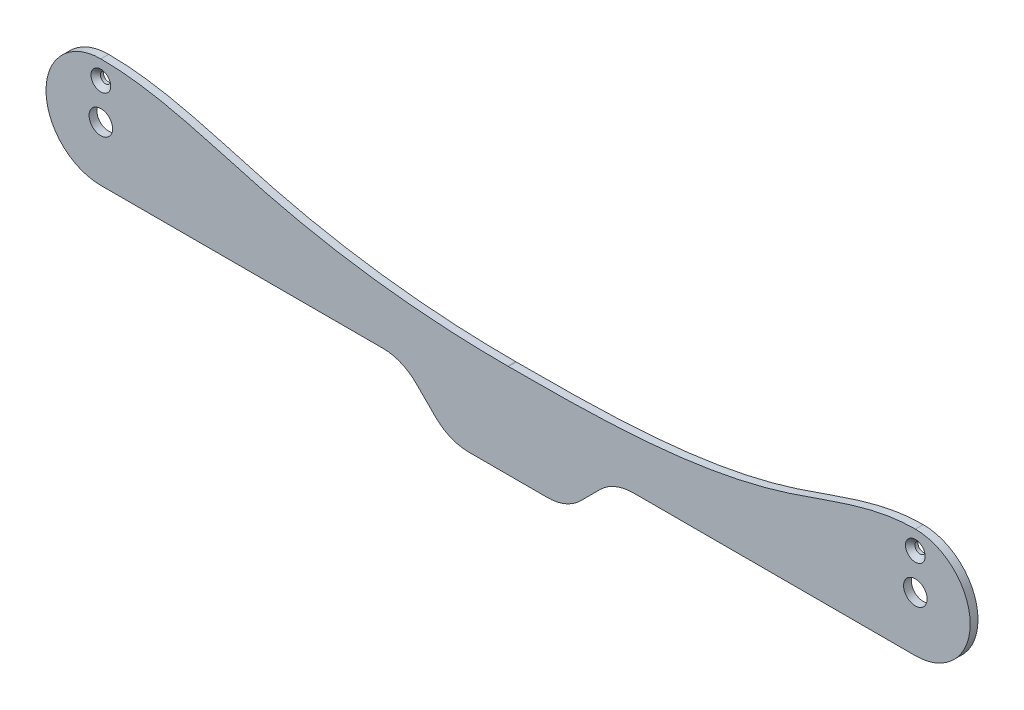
ISO-10303-21;
HEADER;
FILE_DESCRIPTION(('STEP AP214'),'2;1');
FILE_NAME('part.step','',(''),(''),'','','');
FILE_SCHEMA(('AUTOMOTIVE_DESIGN { 1 0 10303 214 1 1 1 1 }'));
ENDSEC;
DATA;
#1=APPLICATION_CONTEXT('core data for automotive mechanical design processes');
#2=APPLICATION_PROTOCOL_DEFINITION('international standard','automotive_design',2000,#1);
#3=PRODUCT_CONTEXT('',#1,'mechanical');
#4=PRODUCT('Part','Part','',(#3));
#5=PRODUCT_RELATED_PRODUCT_CATEGORY('part','',(#4));
#6=PRODUCT_DEFINITION_FORMATION('','',#4);
#7=PRODUCT_DEFINITION_CONTEXT('part definition',#1,'design');
#8=PRODUCT_DEFINITION('design','',#6,#7);
#9=PRODUCT_DEFINITION_SHAPE('','',#8);
#10=(LENGTH_UNIT() NAMED_UNIT(*) SI_UNIT(.MILLI.,.METRE.));
#11=(NAMED_UNIT(*) PLANE_ANGLE_UNIT() SI_UNIT($,.RADIAN.));
#12=(NAMED_UNIT(*) SI_UNIT($,.STERADIAN.) SOLID_ANGLE_UNIT());
#13=UNCERTAINTY_MEASURE_WITH_UNIT(LENGTH_MEASURE(1.E-05),#10,'distance_accuracy_value','');
#14=(GEOMETRIC_REPRESENTATION_CONTEXT(3) GLOBAL_UNCERTAINTY_ASSIGNED_CONTEXT((#13)) GLOBAL_UNIT_ASSIGNED_CONTEXT((#10,
#11,#12)) REPRESENTATION_CONTEXT('',''));
#15=CARTESIAN_POINT('',(0.,0.,0.));
#16=DIRECTION('',(0.,0.,1.));
#17=DIRECTION('',(1.,0.,0.));
#18=AXIS2_PLACEMENT_3D('',#15,#16,#17);
#19=CARTESIAN_POINT('',(-260.,0.,5.));
#20=DIRECTION('',(0.,0.,-1.));
#21=DIRECTION('',(-1.,0.,0.));
#22=AXIS2_PLACEMENT_3D('',#19,#20,#21);
#23=CYLINDRICAL_SURFACE('',#22,35.);
#24=DIRECTION('',(0.,0.,-1.));
#25=VECTOR('',#24,1.);
#26=CARTESIAN_POINT('',(-260.,-35.,5.));
#27=LINE('',#26,#25);
#28=CARTESIAN_POINT('',(-260.,-35.,5.));
#29=VERTEX_POINT('',#28);
#30=CARTESIAN_POINT('',(-260.,-35.,0.));
#31=VERTEX_POINT('',#30);
#32=EDGE_CURVE('E179',#29,#31,#27,.T.);
#33=ORIENTED_EDGE('',*,*,#32,.F.);
#34=CARTESIAN_POINT('',(-260.,0.,5.));
#35=DIRECTION('',(0.,0.,1.));
#36=DIRECTION('',(1.,0.,0.));
#37=AXIS2_PLACEMENT_3D('',#34,#35,#36);
#38=CIRCLE('',#37,35.);
#39=CARTESIAN_POINT('',(-260.,35.,5.));
#40=VERTEX_POINT('',#39);
#41=EDGE_CURVE('E330',#40,#29,#38,.T.);
#42=ORIENTED_EDGE('',*,*,#41,.F.);
#43=DIRECTION('',(0.,0.,-1.));
#44=VECTOR('',#43,1.);
#45=CARTESIAN_POINT('',(-260.,35.,5.));
#46=LINE('',#45,#44);
#47=CARTESIAN_POINT('',(-260.,35.,0.));
#48=VERTEX_POINT('',#47);
#49=EDGE_CURVE('E332',#48,#40,#46,.F.);
#50=ORIENTED_EDGE('',*,*,#49,.F.);
#51=CARTESIAN_POINT('',(-260.,0.,0.));
#52=DIRECTION('',(0.,0.,1.));
#53=DIRECTION('',(1.,0.,0.));
#54=AXIS2_PLACEMENT_3D('',#51,#52,#53);
#55=CIRCLE('',#54,35.);
#56=EDGE_CURVE('E326',#31,#48,#55,.F.);
#57=ORIENTED_EDGE('',*,*,#56,.F.);
#58=EDGE_LOOP('',(#33,#42,#50,#57));
#59=FACE_BOUND('',#58,.T.);
#60=ADVANCED_FACE('F37',(#59),#23,.T.);
#61=CARTESIAN_POINT('',(260.,0.,5.));
#62=DIRECTION('',(0.,0.,-1.));
#63=DIRECTION('',(-1.,0.,0.));
#64=AXIS2_PLACEMENT_3D('',#61,#62,#63);
#65=CYLINDRICAL_SURFACE('',#64,35.);
#66=DIRECTION('',(0.,0.,-1.));
#67=VECTOR('',#66,1.);
#68=CARTESIAN_POINT('',(260.,35.,5.));
#69=LINE('',#68,#67);
#70=CARTESIAN_POINT('',(260.,35.,5.));
#71=VERTEX_POINT('',#70);
#72=CARTESIAN_POINT('',(260.,35.,0.));
#73=VERTEX_POINT('',#72);
#74=EDGE_CURVE('E147',#71,#73,#69,.T.);
#75=ORIENTED_EDGE('',*,*,#74,.F.);
#76=CARTESIAN_POINT('',(260.,0.,5.));
#77=DIRECTION('',(0.,0.,1.));
#78=DIRECTION('',(1.,0.,0.));
#79=AXIS2_PLACEMENT_3D('',#76,#77,#78);
#80=CIRCLE('',#79,35.);
#81=CARTESIAN_POINT('',(260.,-35.,5.));
#82=VERTEX_POINT('',#81);
#83=EDGE_CURVE('E153',#82,#71,#80,.T.);
#84=ORIENTED_EDGE('',*,*,#83,.F.);
#85=DIRECTION('',(0.,0.,-1.));
#86=VECTOR('',#85,1.);
#87=CARTESIAN_POINT('',(260.,-35.,5.));
#88=LINE('',#87,#86);
#89=CARTESIAN_POINT('',(260.,-35.,0.));
#90=VERTEX_POINT('',#89);
#91=EDGE_CURVE('E162',#90,#82,#88,.F.);
#92=ORIENTED_EDGE('',*,*,#91,.F.);
#93=CARTESIAN_POINT('',(260.,0.,0.));
#94=DIRECTION('',(0.,0.,1.));
#95=DIRECTION('',(1.,0.,0.));
#96=AXIS2_PLACEMENT_3D('',#93,#94,#95);
#97=CIRCLE('',#96,35.);
#98=EDGE_CURVE('E161',#73,#90,#97,.F.);
#99=ORIENTED_EDGE('',*,*,#98,.F.);
#100=EDGE_LOOP('',(#75,#84,#92,#99));
#101=FACE_BOUND('',#100,.T.);
#102=ADVANCED_FACE('F165',(#101),#65,.T.);
#103=CARTESIAN_POINT('',(-295.,-35.,5.));
#104=DIRECTION('',(0.,1.,0.));
#105=DIRECTION('',(0.,0.,1.));
#106=AXIS2_PLACEMENT_3D('',#103,#104,#105);
#107=PLANE('',#106);
#108=DIRECTION('',(1.,0.,0.));
#109=VECTOR('',#108,1.);
#110=CARTESIAN_POINT('',(-295.,-35.,0.));
#111=LINE('',#110,#109);
#112=CARTESIAN_POINT('',(-79.9264068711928,-35.,0.));
#113=VERTEX_POINT('',#112);
#114=EDGE_CURVE('E370',#31,#113,#111,.T.);
#115=ORIENTED_EDGE('',*,*,#114,.T.);
#116=DIRECTION('',(0.,0.,-1.));
#117=VECTOR('',#116,1.);
#118=CARTESIAN_POINT('',(-79.9264068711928,-35.,5.));
#119=LINE('',#118,#117);
#120=CARTESIAN_POINT('',(-79.9264068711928,-35.,5.));
#121=VERTEX_POINT('',#120);
#122=EDGE_CURVE('E304',#113,#121,#119,.F.);
#123=ORIENTED_EDGE('',*,*,#122,.T.);
#124=DIRECTION('',(1.,0.,0.));
#125=VECTOR('',#124,1.);
#126=CARTESIAN_POINT('',(-295.,-35.,5.));
#127=LINE('',#126,#125);
#128=EDGE_CURVE('E167',#29,#121,#127,.T.);
#129=ORIENTED_EDGE('',*,*,#128,.F.);
#130=ORIENTED_EDGE('',*,*,#32,.T.);
#131=EDGE_LOOP('',(#115,#123,#129,#130));
#132=FACE_BOUND('',#131,.T.);
#133=ADVANCED_FACE('F248',(#132),#107,.F.);
#134=CARTESIAN_POINT('',(79.9264068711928,-35.,5.));
#135=VERTEX_POINT('',#134);
#136=EDGE_CURVE('E157',#135,#82,#127,.T.);
#137=ORIENTED_EDGE('',*,*,#136,.F.);
#138=DIRECTION('',(0.,0.,-1.));
#139=VECTOR('',#138,1.);
#140=CARTESIAN_POINT('',(79.9264068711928,-35.,5.));
#141=LINE('',#140,#139);
#142=CARTESIAN_POINT('',(79.9264068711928,-35.,0.));
#143=VERTEX_POINT('',#142);
#144=EDGE_CURVE('E306',#135,#143,#141,.T.);
#145=ORIENTED_EDGE('',*,*,#144,.T.);
#146=EDGE_CURVE('E368',#143,#90,#111,.T.);
#147=ORIENTED_EDGE('',*,*,#146,.T.);
#148=ORIENTED_EDGE('',*,*,#91,.T.);
#149=EDGE_LOOP('',(#137,#145,#147,#148));
#150=FACE_BOUND('',#149,.T.);
#151=ADVANCED_FACE('F241',(#150),#107,.F.);
#152=CARTESIAN_POINT('',(0.,0.,5.));
#153=DIRECTION('',(0.,0.,1.));
#154=DIRECTION('',(1.,0.,0.));
#155=AXIS2_PLACEMENT_3D('',#152,#153,#154);
#156=PLANE('',#155);
#157=CARTESIAN_POINT('',(-260.,23.,5.));
#158=DIRECTION('',(0.,0.,1.));
#159=DIRECTION('',(1.,0.,0.));
#160=AXIS2_PLACEMENT_3D('',#157,#158,#159);
#161=CIRCLE('',#160,6.30000000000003);
#162=CARTESIAN_POINT('',(-253.7,23.,5.));
#163=VERTEX_POINT('',#162);
#164=EDGE_CURVE('E590',#163,#163,#161,.T.);
#165=ORIENTED_EDGE('',*,*,#164,.F.);
#166=EDGE_LOOP('',(#165));
#167=FACE_BOUND('',#166,.T.);
#168=CARTESIAN_POINT('',(260.,23.,5.));
#169=DIRECTION('',(0.,0.,1.));
#170=DIRECTION('',(1.,0.,0.));
#171=AXIS2_PLACEMENT_3D('',#168,#169,#170);
#172=CIRCLE('',#171,6.30000000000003);
#173=CARTESIAN_POINT('',(266.3,23.,5.));
#174=VERTEX_POINT('',#173);
#175=EDGE_CURVE('E188',#174,#174,#172,.T.);
#176=ORIENTED_EDGE('',*,*,#175,.F.);
#177=EDGE_LOOP('',(#176));
#178=FACE_BOUND('',#177,.T.);
#179=CARTESIAN_POINT('',(-260.,35.,5.));
#180=CARTESIAN_POINT('',(-223.891175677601,35.,5.));
#181=CARTESIAN_POINT('',(-140.488701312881,4.66700414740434,5.));
#182=CARTESIAN_POINT('',(-52.6489725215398,-5.00000000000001,5.));
#183=CARTESIAN_POINT('',(-0.220779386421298,-5.00000000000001,5.));
#184=B_SPLINE_CURVE_WITH_KNOTS('',3,(#179,#180,#181,#182,#183),.UNSPECIFIED.,.F.,.F.,(4,1,4),
(0.,0.404859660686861,1.),.UNSPECIFIED.);
#185=CARTESIAN_POINT('',(-0.220779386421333,-5.,5.));
#186=VERTEX_POINT('',#185);
#187=EDGE_CURVE('E150',#40,#186,#184,.T.);
#188=ORIENTED_EDGE('',*,*,#187,.F.);
#189=ORIENTED_EDGE('',*,*,#41,.T.);
#190=ORIENTED_EDGE('',*,*,#128,.T.);
#191=CARTESIAN_POINT('',(-79.9264068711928,-65.,5.));
#192=DIRECTION('',(0.,0.,1.));
#193=DIRECTION('',(1.,0.,0.));
#194=AXIS2_PLACEMENT_3D('',#191,#192,#193);
#195=CIRCLE('',#194,30.);
#196=CARTESIAN_POINT('',(-58.7132034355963,-43.7867965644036,5.));
#197=VERTEX_POINT('',#196);
#198=EDGE_CURVE('E323',#121,#197,#195,.F.);
#199=ORIENTED_EDGE('',*,*,#198,.T.);
#200=DIRECTION('',(-0.707106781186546,0.707106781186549,0.));
#201=VECTOR('',#200,1.);
#202=CARTESIAN_POINT('',(-51.2500000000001,-51.2499999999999,5.));
#203=LINE('',#202,#201);
#204=CARTESIAN_POINT('',(-46.2867965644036,-56.2132034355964,5.));
#205=VERTEX_POINT('',#204);
#206=EDGE_CURVE('E362',#205,#197,#203,.T.);
#207=ORIENTED_EDGE('',*,*,#206,.F.);
#208=CARTESIAN_POINT('',(-25.0735931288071,-35.,5.));
#209=DIRECTION('',(0.,0.,1.));
#210=DIRECTION('',(1.,0.,0.));
#211=AXIS2_PLACEMENT_3D('',#208,#209,#210);
#212=CIRCLE('',#211,30.);
#213=CARTESIAN_POINT('',(-25.0735931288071,-65.,5.));
#214=VERTEX_POINT('',#213);
#215=EDGE_CURVE('E288',#205,#214,#212,.T.);
#216=ORIENTED_EDGE('',*,*,#215,.T.);
#217=DIRECTION('',(-1.,0.,0.));
#218=VECTOR('',#217,1.);
#219=CARTESIAN_POINT('',(0.,-65.,5.));
#220=LINE('',#219,#218);
#221=CARTESIAN_POINT('',(25.0735931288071,-65.,5.));
#222=VERTEX_POINT('',#221);
#223=EDGE_CURVE('E366',#222,#214,#220,.T.);
#224=ORIENTED_EDGE('',*,*,#223,.F.);
#225=CARTESIAN_POINT('',(25.0735931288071,-35.,5.));
#226=DIRECTION('',(0.,0.,1.));
#227=DIRECTION('',(1.,0.,0.));
#228=AXIS2_PLACEMENT_3D('',#225,#226,#227);
#229=CIRCLE('',#228,30.);
#230=CARTESIAN_POINT('',(46.2867965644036,-56.2132034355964,5.));
#231=VERTEX_POINT('',#230);
#232=EDGE_CURVE('E281',#222,#231,#229,.T.);
#233=ORIENTED_EDGE('',*,*,#232,.T.);
#234=DIRECTION('',(-0.707106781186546,-0.707106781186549,0.));
#235=VECTOR('',#234,1.);
#236=CARTESIAN_POINT('',(51.2500000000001,-51.2499999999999,5.));
#237=LINE('',#236,#235);
#238=CARTESIAN_POINT('',(58.7132034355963,-43.7867965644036,5.));
#239=VERTEX_POINT('',#238);
#240=EDGE_CURVE('E365',#239,#231,#237,.T.);
#241=ORIENTED_EDGE('',*,*,#240,.F.);
#242=CARTESIAN_POINT('',(79.9264068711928,-65.,5.));
#243=DIRECTION('',(0.,0.,1.));
#244=DIRECTION('',(1.,0.,0.));
#245=AXIS2_PLACEMENT_3D('',#242,#243,#244);
#246=CIRCLE('',#245,30.);
#247=EDGE_CURVE('E11',#239,#135,#246,.F.);
#248=ORIENTED_EDGE('',*,*,#247,.T.);
#249=ORIENTED_EDGE('',*,*,#136,.T.);
#250=ORIENTED_EDGE('',*,*,#83,.T.);
#251=CARTESIAN_POINT('',(-0.220779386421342,-5.,5.));
#252=CARTESIAN_POINT('',(59.3599443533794,-5.,5.));
#253=CARTESIAN_POINT('',(148.555315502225,-3.78516973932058,5.));
#254=CARTESIAN_POINT('',(231.715697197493,35.,5.));
#255=CARTESIAN_POINT('',(260.,35.,5.));
#256=B_SPLINE_CURVE_WITH_KNOTS('',3,(#251,#252,#253,#254,#255),.UNSPECIFIED.,.F.,.F.,(4,1,4),
(0.,0.676281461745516,1.),.UNSPECIFIED.);
#257=CARTESIAN_POINT('',(0.253315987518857,-4.99998235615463,5.));
#258=VERTEX_POINT('',#257);
#259=EDGE_CURVE('E143',#258,#71,#256,.T.);
#260=ORIENTED_EDGE('',*,*,#259,.F.);
#261=CARTESIAN_POINT('',(0.220779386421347,25.,5.));
#262=DIRECTION('',(0.,0.,1.));
#263=DIRECTION('',(1.,0.,0.));
#264=AXIS2_PLACEMENT_3D('',#261,#262,#263);
#265=CIRCLE('',#264,30.);
#266=CARTESIAN_POINT('',(0.220779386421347,-5.,5.));
#267=VERTEX_POINT('',#266);
#268=EDGE_CURVE('E319',#258,#267,#265,.F.);
#269=ORIENTED_EDGE('',*,*,#268,.T.);
#270=DIRECTION('',(1.,0.,0.));
#271=VECTOR('',#270,1.);
#272=CARTESIAN_POINT('',(0.,-5.,5.));
#273=LINE('',#272,#271);
#274=EDGE_CURVE('E398',#186,#267,#273,.T.);
#275=ORIENTED_EDGE('',*,*,#274,.F.);
#276=EDGE_LOOP('',(#188,#189,#190,#199,#207,#216,#224,#233,#241,#248,#249,#250,#260,#269,#275));
#277=FACE_BOUND('',#276,.T.);
#278=CARTESIAN_POINT('',(-260.,0.,5.));
#279=DIRECTION('',(0.,0.,1.));
#280=DIRECTION('',(1.,0.,0.));
#281=AXIS2_PLACEMENT_3D('',#278,#279,#280);
#282=CIRCLE('',#281,7.50000000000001);
#283=CARTESIAN_POINT('',(-252.5,0.,5.));
#284=VERTEX_POINT('',#283);
#285=EDGE_CURVE('E401',#284,#284,#282,.T.);
#286=ORIENTED_EDGE('',*,*,#285,.F.);
#287=EDGE_LOOP('',(#286));
#288=FACE_BOUND('',#287,.T.);
#289=CARTESIAN_POINT('',(260.,0.,5.));
#290=DIRECTION('',(0.,0.,1.));
#291=DIRECTION('',(1.,0.,0.));
#292=AXIS2_PLACEMENT_3D('',#289,#290,#291);
#293=CIRCLE('',#292,7.50000000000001);
#294=CARTESIAN_POINT('',(267.5,0.,5.));
#295=VERTEX_POINT('',#294);
#296=EDGE_CURVE('E358',#295,#295,#293,.T.);
#297=ORIENTED_EDGE('',*,*,#296,.F.);
#298=EDGE_LOOP('',(#297));
#299=FACE_BOUND('',#298,.T.);
#300=ADVANCED_FACE('F155',(#167,#178,#277,#288,#299),#156,.T.);
#301=CARTESIAN_POINT('',(0.,0.,0.));
#302=DIRECTION('',(0.,0.,1.));
#303=DIRECTION('',(1.,0.,0.));
#304=AXIS2_PLACEMENT_3D('',#301,#302,#303);
#305=PLANE('',#304);
#306=CARTESIAN_POINT('',(-260.,23.,0.));
#307=DIRECTION('',(0.,0.,1.));
#308=DIRECTION('',(1.,0.,0.));
#309=AXIS2_PLACEMENT_3D('',#306,#307,#308);
#310=CIRCLE('',#309,3.30000000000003);
#311=CARTESIAN_POINT('',(-256.7,23.,0.));
#312=VERTEX_POINT('',#311);
#313=EDGE_CURVE('E41',#312,#312,#310,.T.);
#314=ORIENTED_EDGE('',*,*,#313,.T.);
#315=EDGE_LOOP('',(#314));
#316=FACE_BOUND('',#315,.T.);
#317=CARTESIAN_POINT('',(260.,23.,0.));
#318=DIRECTION('',(0.,0.,1.));
#319=DIRECTION('',(1.,0.,0.));
#320=AXIS2_PLACEMENT_3D('',#317,#318,#319);
#321=CIRCLE('',#320,3.30000000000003);
#322=CARTESIAN_POINT('',(263.3,23.,0.));
#323=VERTEX_POINT('',#322);
#324=EDGE_CURVE('E181',#323,#323,#321,.T.);
#325=ORIENTED_EDGE('',*,*,#324,.T.);
#326=EDGE_LOOP('',(#325));
#327=FACE_BOUND('',#326,.T.);
#328=CARTESIAN_POINT('',(-260.,0.,0.));
#329=DIRECTION('',(0.,0.,1.));
#330=DIRECTION('',(1.,0.,0.));
#331=AXIS2_PLACEMENT_3D('',#328,#329,#330);
#332=CIRCLE('',#331,7.50000000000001);
#333=CARTESIAN_POINT('',(-252.5,0.,0.));
#334=VERTEX_POINT('',#333);
#335=EDGE_CURVE('E404',#334,#334,#332,.T.);
#336=ORIENTED_EDGE('',*,*,#335,.T.);
#337=EDGE_LOOP('',(#336));
#338=FACE_BOUND('',#337,.T.);
#339=CARTESIAN_POINT('',(260.,0.,0.));
#340=DIRECTION('',(0.,0.,1.));
#341=DIRECTION('',(1.,0.,0.));
#342=AXIS2_PLACEMENT_3D('',#339,#340,#341);
#343=CIRCLE('',#342,7.50000000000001);
#344=CARTESIAN_POINT('',(267.5,0.,0.));
#345=VERTEX_POINT('',#344);
#346=EDGE_CURVE('E353',#345,#345,#343,.T.);
#347=ORIENTED_EDGE('',*,*,#346,.T.);
#348=EDGE_LOOP('',(#347));
#349=FACE_BOUND('',#348,.T.);
#350=ORIENTED_EDGE('',*,*,#56,.T.);
#351=CARTESIAN_POINT('',(-260.,35.,0.));
#352=CARTESIAN_POINT('',(-223.891175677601,35.,0.));
#353=CARTESIAN_POINT('',(-140.488701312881,4.66700414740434,0.));
#354=CARTESIAN_POINT('',(-52.6489725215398,-5.00000000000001,0.));
#355=CARTESIAN_POINT('',(-0.220779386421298,-5.00000000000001,0.));
#356=B_SPLINE_CURVE_WITH_KNOTS('',3,(#351,#352,#353,#354,#355),.UNSPECIFIED.,.F.,.F.,(4,1,4),
(0.,0.404859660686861,1.),.UNSPECIFIED.);
#357=CARTESIAN_POINT('',(-0.220779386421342,-5.,0.));
#358=VERTEX_POINT('',#357);
#359=EDGE_CURVE('E375',#48,#358,#356,.T.);
#360=ORIENTED_EDGE('',*,*,#359,.T.);
#361=DIRECTION('',(-1.,0.,0.));
#362=VECTOR('',#361,1.);
#363=CARTESIAN_POINT('',(0.,-5.,0.));
#364=LINE('',#363,#362);
#365=CARTESIAN_POINT('',(0.220779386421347,-5.,0.));
#366=VERTEX_POINT('',#365);
#367=EDGE_CURVE('E378',#366,#358,#364,.T.);
#368=ORIENTED_EDGE('',*,*,#367,.F.);
#369=CARTESIAN_POINT('',(0.220779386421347,25.,0.));
#370=DIRECTION('',(0.,0.,1.));
#371=DIRECTION('',(1.,0.,0.));
#372=AXIS2_PLACEMENT_3D('',#369,#370,#371);
#373=CIRCLE('',#372,30.);
#374=CARTESIAN_POINT('',(0.253315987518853,-4.99998235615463,0.));
#375=VERTEX_POINT('',#374);
#376=EDGE_CURVE('E316',#366,#375,#373,.T.);
#377=ORIENTED_EDGE('',*,*,#376,.T.);
#378=CARTESIAN_POINT('',(-0.220779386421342,-5.,0.));
#379=CARTESIAN_POINT('',(59.3599443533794,-5.,0.));
#380=CARTESIAN_POINT('',(148.555315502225,-3.78516973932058,0.));
#381=CARTESIAN_POINT('',(231.715697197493,35.,0.));
#382=CARTESIAN_POINT('',(260.,35.,0.));
#383=B_SPLINE_CURVE_WITH_KNOTS('',3,(#378,#379,#380,#381,#382),.UNSPECIFIED.,.F.,.F.,(4,1,4),
(0.,0.676281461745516,1.),.UNSPECIFIED.);
#384=EDGE_CURVE('E54',#375,#73,#383,.T.);
#385=ORIENTED_EDGE('',*,*,#384,.T.);
#386=ORIENTED_EDGE('',*,*,#98,.T.);
#387=ORIENTED_EDGE('',*,*,#146,.F.);
#388=CARTESIAN_POINT('',(79.9264068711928,-65.,0.));
#389=DIRECTION('',(0.,0.,1.));
#390=DIRECTION('',(1.,0.,0.));
#391=AXIS2_PLACEMENT_3D('',#388,#389,#390);
#392=CIRCLE('',#391,30.);
#393=CARTESIAN_POINT('',(58.7132034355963,-43.7867965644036,0.));
#394=VERTEX_POINT('',#393);
#395=EDGE_CURVE('E46',#143,#394,#392,.T.);
#396=ORIENTED_EDGE('',*,*,#395,.T.);
#397=DIRECTION('',(-0.707106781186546,-0.707106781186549,0.));
#398=VECTOR('',#397,1.);
#399=CARTESIAN_POINT('',(51.2500000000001,-51.2499999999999,0.));
#400=LINE('',#399,#398);
#401=CARTESIAN_POINT('',(46.2867965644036,-56.2132034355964,0.));
#402=VERTEX_POINT('',#401);
#403=EDGE_CURVE('E349',#394,#402,#400,.T.);
#404=ORIENTED_EDGE('',*,*,#403,.T.);
#405=CARTESIAN_POINT('',(25.0735931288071,-35.,0.));
#406=DIRECTION('',(0.,0.,1.));
#407=DIRECTION('',(1.,0.,0.));
#408=AXIS2_PLACEMENT_3D('',#405,#406,#407);
#409=CIRCLE('',#408,30.);
#410=CARTESIAN_POINT('',(25.0735931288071,-65.,0.));
#411=VERTEX_POINT('',#410);
#412=EDGE_CURVE('E293',#402,#411,#409,.F.);
#413=ORIENTED_EDGE('',*,*,#412,.T.);
#414=DIRECTION('',(-1.,0.,0.));
#415=VECTOR('',#414,1.);
#416=CARTESIAN_POINT('',(0.,-65.,0.));
#417=LINE('',#416,#415);
#418=CARTESIAN_POINT('',(-25.0735931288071,-65.,0.));
#419=VERTEX_POINT('',#418);
#420=EDGE_CURVE('E347',#411,#419,#417,.T.);
#421=ORIENTED_EDGE('',*,*,#420,.T.);
#422=CARTESIAN_POINT('',(-25.0735931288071,-35.,0.));
#423=DIRECTION('',(0.,0.,1.));
#424=DIRECTION('',(1.,0.,0.));
#425=AXIS2_PLACEMENT_3D('',#422,#423,#424);
#426=CIRCLE('',#425,30.);
#427=CARTESIAN_POINT('',(-46.2867965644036,-56.2132034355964,0.));
#428=VERTEX_POINT('',#427);
#429=EDGE_CURVE('E329',#419,#428,#426,.F.);
#430=ORIENTED_EDGE('',*,*,#429,.T.);
#431=DIRECTION('',(-0.707106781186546,0.707106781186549,0.));
#432=VECTOR('',#431,1.);
#433=CARTESIAN_POINT('',(-51.2500000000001,-51.2499999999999,0.));
#434=LINE('',#433,#432);
#435=CARTESIAN_POINT('',(-58.7132034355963,-43.7867965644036,0.));
#436=VERTEX_POINT('',#435);
#437=EDGE_CURVE('E352',#428,#436,#434,.T.);
#438=ORIENTED_EDGE('',*,*,#437,.T.);
#439=CARTESIAN_POINT('',(-79.9264068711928,-65.,0.));
#440=DIRECTION('',(0.,0.,1.));
#441=DIRECTION('',(1.,0.,0.));
#442=AXIS2_PLACEMENT_3D('',#439,#440,#441);
#443=CIRCLE('',#442,30.);
#444=EDGE_CURVE('E321',#436,#113,#443,.T.);
#445=ORIENTED_EDGE('',*,*,#444,.T.);
#446=ORIENTED_EDGE('',*,*,#114,.F.);
#447=EDGE_LOOP('',(#350,#360,#368,#377,#385,#386,#387,#396,#404,#413,#421,#430,#438,#445,#446));
#448=FACE_BOUND('',#447,.T.);
#449=ADVANCED_FACE('F237',(#316,#327,#338,#349,#448),#305,.F.);
#450=CARTESIAN_POINT('',(-51.2500000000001,-51.2499999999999,143.293166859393));
#451=DIRECTION('',(-0.707106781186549,-0.707106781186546,0.));
#452=DIRECTION('',(0.707106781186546,-0.707106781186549,0.));
#453=AXIS2_PLACEMENT_3D('',#450,#451,#452);
#454=PLANE('',#453);
#455=ORIENTED_EDGE('',*,*,#206,.T.);
#456=DIRECTION('',(0.,0.,-1.));
#457=VECTOR('',#456,1.);
#458=CARTESIAN_POINT('',(-58.7132034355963,-43.7867965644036,143.293166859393));
#459=LINE('',#458,#457);
#460=EDGE_CURVE('E301',#197,#436,#459,.T.);
#461=ORIENTED_EDGE('',*,*,#460,.T.);
#462=ORIENTED_EDGE('',*,*,#437,.F.);
#463=DIRECTION('',(0.,0.,-1.));
#464=VECTOR('',#463,1.);
#465=CARTESIAN_POINT('',(-46.2867965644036,-56.2132034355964,143.293166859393));
#466=LINE('',#465,#464);
#467=EDGE_CURVE('E299',#428,#205,#466,.F.);
#468=ORIENTED_EDGE('',*,*,#467,.T.);
#469=EDGE_LOOP('',(#455,#461,#462,#468));
#470=FACE_BOUND('',#469,.T.);
#471=ADVANCED_FACE('F233',(#470),#454,.T.);
#472=CARTESIAN_POINT('',(51.2500000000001,-51.2499999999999,143.293166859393));
#473=DIRECTION('',(0.707106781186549,-0.707106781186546,0.));
#474=DIRECTION('',(0.707106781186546,0.707106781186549,0.));
#475=AXIS2_PLACEMENT_3D('',#472,#473,#474);
#476=PLANE('',#475);
#477=ORIENTED_EDGE('',*,*,#403,.F.);
#478=DIRECTION('',(0.,0.,-1.));
#479=VECTOR('',#478,1.);
#480=CARTESIAN_POINT('',(58.7132034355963,-43.7867965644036,143.293166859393));
#481=LINE('',#480,#479);
#482=EDGE_CURVE('E310',#394,#239,#481,.F.);
#483=ORIENTED_EDGE('',*,*,#482,.T.);
#484=ORIENTED_EDGE('',*,*,#240,.T.);
#485=DIRECTION('',(0.,0.,-1.));
#486=VECTOR('',#485,1.);
#487=CARTESIAN_POINT('',(46.2867965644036,-56.2132034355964,143.293166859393));
#488=LINE('',#487,#486);
#489=EDGE_CURVE('E284',#231,#402,#488,.T.);
#490=ORIENTED_EDGE('',*,*,#489,.T.);
#491=EDGE_LOOP('',(#477,#483,#484,#490));
#492=FACE_BOUND('',#491,.T.);
#493=ADVANCED_FACE('F229',(#492),#476,.T.);
#494=CARTESIAN_POINT('',(0.,-65.,143.293166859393));
#495=DIRECTION('',(0.,-1.,0.));
#496=DIRECTION('',(0.,0.,-1.));
#497=AXIS2_PLACEMENT_3D('',#494,#495,#496);
#498=PLANE('',#497);
#499=ORIENTED_EDGE('',*,*,#420,.F.);
#500=DIRECTION('',(0.,0.,-1.));
#501=VECTOR('',#500,1.);
#502=CARTESIAN_POINT('',(25.0735931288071,-65.,143.293166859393));
#503=LINE('',#502,#501);
#504=EDGE_CURVE('E282',#411,#222,#503,.F.);
#505=ORIENTED_EDGE('',*,*,#504,.T.);
#506=ORIENTED_EDGE('',*,*,#223,.T.);
#507=DIRECTION('',(0.,0.,-1.));
#508=VECTOR('',#507,1.);
#509=CARTESIAN_POINT('',(-25.0735931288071,-65.,143.293166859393));
#510=LINE('',#509,#508);
#511=EDGE_CURVE('E312',#214,#419,#510,.T.);
#512=ORIENTED_EDGE('',*,*,#511,.T.);
#513=EDGE_LOOP('',(#499,#505,#506,#512));
#514=FACE_BOUND('',#513,.T.);
#515=ADVANCED_FACE('F225',(#514),#498,.T.);
#516=CARTESIAN_POINT('',(260.,0.,5.));
#517=DIRECTION('',(0.,0.,1.));
#518=DIRECTION('',(1.,0.,0.));
#519=AXIS2_PLACEMENT_3D('',#516,#517,#518);
#520=CYLINDRICAL_SURFACE('',#519,7.50000000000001);
#521=ORIENTED_EDGE('',*,*,#346,.F.);
#522=EDGE_LOOP('',(#521));
#523=FACE_BOUND('',#522,.T.);
#524=ORIENTED_EDGE('',*,*,#296,.T.);
#525=EDGE_LOOP('',(#524));
#526=FACE_BOUND('',#525,.T.);
#527=ADVANCED_FACE('F221',(#523,#526),#520,.F.);
#528=CARTESIAN_POINT('',(-260.,0.,5.));
#529=DIRECTION('',(0.,0.,1.));
#530=DIRECTION('',(1.,0.,0.));
#531=AXIS2_PLACEMENT_3D('',#528,#529,#530);
#532=CYLINDRICAL_SURFACE('',#531,7.50000000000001);
#533=ORIENTED_EDGE('',*,*,#335,.F.);
#534=EDGE_LOOP('',(#533));
#535=FACE_BOUND('',#534,.T.);
#536=ORIENTED_EDGE('',*,*,#285,.T.);
#537=EDGE_LOOP('',(#536));
#538=FACE_BOUND('',#537,.T.);
#539=ADVANCED_FACE('F217',(#535,#538),#532,.F.);
#540=CARTESIAN_POINT('',(0.,-5.,10.));
#541=DIRECTION('',(0.,-1.,0.));
#542=DIRECTION('',(0.,0.,-1.));
#543=AXIS2_PLACEMENT_3D('',#540,#541,#542);
#544=PLANE('',#543);
#545=ORIENTED_EDGE('',*,*,#274,.T.);
#546=DIRECTION('',(0.,0.,-1.));
#547=VECTOR('',#546,1.);
#548=CARTESIAN_POINT('',(0.220779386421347,-5.,0.));
#549=LINE('',#548,#547);
#550=EDGE_CURVE('E291',#267,#366,#549,.T.);
#551=ORIENTED_EDGE('',*,*,#550,.T.);
#552=ORIENTED_EDGE('',*,*,#367,.T.);
#553=DIRECTION('',(0.,0.,-1.));
#554=VECTOR('',#553,1.);
#555=CARTESIAN_POINT('',(-0.220779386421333,-5.,5.));
#556=LINE('',#555,#554);
#557=EDGE_CURVE('E287',#358,#186,#556,.F.);
#558=ORIENTED_EDGE('',*,*,#557,.T.);
#559=EDGE_LOOP('',(#545,#551,#552,#558));
#560=FACE_BOUND('',#559,.T.);
#561=ADVANCED_FACE('F213',(#560),#544,.F.);
#562=CARTESIAN_POINT('',(0.220779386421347,25.,10.));
#563=DIRECTION('',(0.,0.,1.));
#564=DIRECTION('',(1.,0.,0.));
#565=AXIS2_PLACEMENT_3D('',#562,#563,#564);
#566=CYLINDRICAL_SURFACE('',#565,30.);
#567=ORIENTED_EDGE('',*,*,#268,.F.);
#568=DIRECTION('',(0.,0.,1.));
#569=VECTOR('',#568,1.);
#570=CARTESIAN_POINT('',(0.253315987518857,-4.99998235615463,-5.));
#571=LINE('',#570,#569);
#572=EDGE_CURVE('E148',#258,#375,#571,.F.);
#573=ORIENTED_EDGE('',*,*,#572,.T.);
#574=ORIENTED_EDGE('',*,*,#376,.F.);
#575=ORIENTED_EDGE('',*,*,#550,.F.);
#576=EDGE_LOOP('',(#567,#573,#574,#575));
#577=FACE_BOUND('',#576,.T.);
#578=ADVANCED_FACE('F216',(#577),#566,.F.);
#579=CARTESIAN_POINT('',(-79.9264068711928,-65.,143.293166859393));
#580=DIRECTION('',(0.,0.,-1.));
#581=DIRECTION('',(-1.,0.,0.));
#582=AXIS2_PLACEMENT_3D('',#579,#580,#581);
#583=CYLINDRICAL_SURFACE('',#582,30.);
#584=ORIENTED_EDGE('',*,*,#198,.F.);
#585=ORIENTED_EDGE('',*,*,#122,.F.);
#586=ORIENTED_EDGE('',*,*,#444,.F.);
#587=ORIENTED_EDGE('',*,*,#460,.F.);
#588=EDGE_LOOP('',(#584,#585,#586,#587));
#589=FACE_BOUND('',#588,.T.);
#590=ADVANCED_FACE('F263',(#589),#583,.F.);
#591=CARTESIAN_POINT('',(79.9264068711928,-65.,5.));
#592=DIRECTION('',(0.,0.,-1.));
#593=DIRECTION('',(-1.,0.,0.));
#594=AXIS2_PLACEMENT_3D('',#591,#592,#593);
#595=CYLINDRICAL_SURFACE('',#594,30.);
#596=ORIENTED_EDGE('',*,*,#247,.F.);
#597=ORIENTED_EDGE('',*,*,#482,.F.);
#598=ORIENTED_EDGE('',*,*,#395,.F.);
#599=ORIENTED_EDGE('',*,*,#144,.F.);
#600=EDGE_LOOP('',(#596,#597,#598,#599));
#601=FACE_BOUND('',#600,.T.);
#602=ADVANCED_FACE('F267',(#601),#595,.F.);
#603=CARTESIAN_POINT('',(25.0735931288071,-35.,143.293166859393));
#604=DIRECTION('',(0.,0.,-1.));
#605=DIRECTION('',(-1.,0.,0.));
#606=AXIS2_PLACEMENT_3D('',#603,#604,#605);
#607=CYLINDRICAL_SURFACE('',#606,30.);
#608=ORIENTED_EDGE('',*,*,#232,.F.);
#609=ORIENTED_EDGE('',*,*,#504,.F.);
#610=ORIENTED_EDGE('',*,*,#412,.F.);
#611=ORIENTED_EDGE('',*,*,#489,.F.);
#612=EDGE_LOOP('',(#608,#609,#610,#611));
#613=FACE_BOUND('',#612,.T.);
#614=ADVANCED_FACE('F270',(#613),#607,.T.);
#615=CARTESIAN_POINT('',(-25.0735931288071,-35.,143.293166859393));
#616=DIRECTION('',(0.,0.,-1.));
#617=DIRECTION('',(-1.,0.,0.));
#618=AXIS2_PLACEMENT_3D('',#615,#616,#617);
#619=CYLINDRICAL_SURFACE('',#618,30.);
#620=ORIENTED_EDGE('',*,*,#215,.F.);
#621=ORIENTED_EDGE('',*,*,#467,.F.);
#622=ORIENTED_EDGE('',*,*,#429,.F.);
#623=ORIENTED_EDGE('',*,*,#511,.F.);
#624=EDGE_LOOP('',(#620,#621,#622,#623));
#625=FACE_BOUND('',#624,.T.);
#626=ADVANCED_FACE('F39',(#625),#619,.T.);
#627=CARTESIAN_POINT('',(-260.,35.,-5.));
#628=CARTESIAN_POINT('',(-223.891175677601,35.,-5.));
#629=CARTESIAN_POINT('',(-140.488701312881,4.66700414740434,-5.));
#630=CARTESIAN_POINT('',(-52.6489725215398,-5.00000000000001,-5.));
#631=CARTESIAN_POINT('',(-0.220779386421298,-5.00000000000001,-5.));
#632=B_SPLINE_CURVE_WITH_KNOTS('',3,(#627,#628,#629,#630,#631),.UNSPECIFIED.,.F.,.F.,(4,1,4),
(0.,0.404859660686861,1.),.UNSPECIFIED.);
#633=DIRECTION('',(0.,0.,1.));
#634=VECTOR('',#633,1.);
#635=SURFACE_OF_LINEAR_EXTRUSION('',#632,#634);
#636=ORIENTED_EDGE('',*,*,#49,.T.);
#637=ORIENTED_EDGE('',*,*,#187,.T.);
#638=ORIENTED_EDGE('',*,*,#557,.F.);
#639=ORIENTED_EDGE('',*,*,#359,.F.);
#640=EDGE_LOOP('',(#636,#637,#638,#639));
#641=FACE_BOUND('',#640,.T.);
#642=ADVANCED_FACE('F207',(#641),#635,.F.);
#643=CARTESIAN_POINT('',(-0.220779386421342,-5.,-5.));
#644=CARTESIAN_POINT('',(59.3599443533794,-5.,-5.));
#645=CARTESIAN_POINT('',(148.555315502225,-3.78516973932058,-5.));
#646=CARTESIAN_POINT('',(231.715697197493,35.,-5.));
#647=CARTESIAN_POINT('',(260.,35.,-5.));
#648=B_SPLINE_CURVE_WITH_KNOTS('',3,(#643,#644,#645,#646,#647),.UNSPECIFIED.,.F.,.F.,(4,1,4),
(0.,0.676281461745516,1.),.UNSPECIFIED.);
#649=DIRECTION('',(0.,0.,1.));
#650=VECTOR('',#649,1.);
#651=SURFACE_OF_LINEAR_EXTRUSION('',#648,#650);
#652=ORIENTED_EDGE('',*,*,#572,.F.);
#653=ORIENTED_EDGE('',*,*,#259,.T.);
#654=ORIENTED_EDGE('',*,*,#74,.T.);
#655=ORIENTED_EDGE('',*,*,#384,.F.);
#656=EDGE_LOOP('',(#652,#653,#654,#655));
#657=FACE_BOUND('',#656,.T.);
#658=ADVANCED_FACE('F145',(#657),#651,.F.);
#659=CARTESIAN_POINT('',(260.,23.,5.));
#660=DIRECTION('',(0.,0.,1.));
#661=DIRECTION('',(1.,0.,0.));
#662=AXIS2_PLACEMENT_3D('',#659,#660,#661);
#663=CYLINDRICAL_SURFACE('',#662,3.30000000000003);
#664=CARTESIAN_POINT('',(260.,23.,2.));
#665=DIRECTION('',(0.,0.,1.));
#666=DIRECTION('',(1.,0.,0.));
#667=AXIS2_PLACEMENT_3D('',#664,#665,#666);
#668=CIRCLE('',#667,3.30000000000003);
#669=CARTESIAN_POINT('',(263.3,23.,2.));
#670=VERTEX_POINT('',#669);
#671=EDGE_CURVE('E183',#670,#670,#668,.T.);
#672=ORIENTED_EDGE('',*,*,#671,.T.);
#673=EDGE_LOOP('',(#672));
#674=FACE_BOUND('',#673,.T.);
#675=ORIENTED_EDGE('',*,*,#324,.F.);
#676=EDGE_LOOP('',(#675));
#677=FACE_BOUND('',#676,.T.);
#678=ADVANCED_FACE('F545',(#674,#677),#663,.F.);
#679=CARTESIAN_POINT('',(260.,23.,5.));
#680=DIRECTION('',(0.,0.,1.));
#681=DIRECTION('',(1.,0.,0.));
#682=AXIS2_PLACEMENT_3D('',#679,#680,#681);
#683=CONICAL_SURFACE('',#682,6.30000000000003,0.785398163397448);
#684=ORIENTED_EDGE('',*,*,#671,.F.);
#685=EDGE_LOOP('',(#684));
#686=FACE_BOUND('',#685,.T.);
#687=ORIENTED_EDGE('',*,*,#175,.T.);
#688=EDGE_LOOP('',(#687));
#689=FACE_BOUND('',#688,.T.);
#690=ADVANCED_FACE('F551',(#686,#689),#683,.F.);
#691=CARTESIAN_POINT('',(-260.,23.,5.));
#692=DIRECTION('',(0.,0.,1.));
#693=DIRECTION('',(1.,0.,0.));
#694=AXIS2_PLACEMENT_3D('',#691,#692,#693);
#695=CYLINDRICAL_SURFACE('',#694,3.30000000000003);
#696=CARTESIAN_POINT('',(-260.,23.,2.));
#697=DIRECTION('',(0.,0.,1.));
#698=DIRECTION('',(1.,0.,0.));
#699=AXIS2_PLACEMENT_3D('',#696,#697,#698);
#700=CIRCLE('',#699,3.30000000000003);
#701=CARTESIAN_POINT('',(-256.7,23.,2.));
#702=VERTEX_POINT('',#701);
#703=EDGE_CURVE('E587',#702,#702,#700,.T.);
#704=ORIENTED_EDGE('',*,*,#703,.T.);
#705=EDGE_LOOP('',(#704));
#706=FACE_BOUND('',#705,.T.);
#707=ORIENTED_EDGE('',*,*,#313,.F.);
#708=EDGE_LOOP('',(#707));
#709=FACE_BOUND('',#708,.T.);
#710=ADVANCED_FACE('F558',(#706,#709),#695,.F.);
#711=CARTESIAN_POINT('',(-260.,23.,5.));
#712=DIRECTION('',(0.,0.,1.));
#713=DIRECTION('',(1.,0.,0.));
#714=AXIS2_PLACEMENT_3D('',#711,#712,#713);
#715=CONICAL_SURFACE('',#714,6.30000000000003,0.785398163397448);
#716=ORIENTED_EDGE('',*,*,#703,.F.);
#717=EDGE_LOOP('',(#716));
#718=FACE_BOUND('',#717,.T.);
#719=ORIENTED_EDGE('',*,*,#164,.T.);
#720=EDGE_LOOP('',(#719));
#721=FACE_BOUND('',#720,.T.);
#722=ADVANCED_FACE('F567',(#718,#721),#715,.F.);
#723=CLOSED_SHELL('',(#60,#102,#133,#151,#300,#449,#471,#493,#515,#527,#539,#561,#578,#590,#602,
#614,#626,#642,#658,#678,#690,#710,#722));
#724=MANIFOLD_SOLID_BREP('B2',#723);
#725=ADVANCED_BREP_SHAPE_REPRESENTATION('',(#18,#724),#14);
#726=SHAPE_DEFINITION_REPRESENTATION(#9,#725);
ENDSEC;
END-ISO-10303-21;
